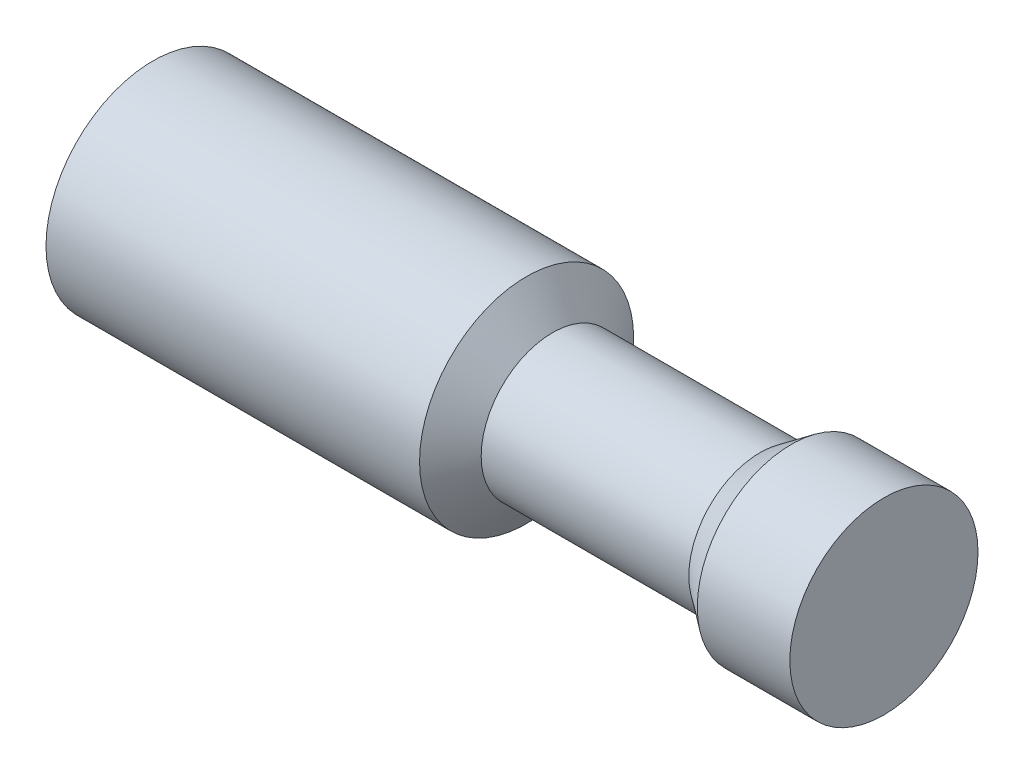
ISO-10303-21;
HEADER;
FILE_DESCRIPTION(('STEP AP214'),'2;1');
FILE_NAME('part.step','',(''),(''),'','','');
FILE_SCHEMA(('AUTOMOTIVE_DESIGN { 1 0 10303 214 1 1 1 1 }'));
ENDSEC;
DATA;
#1=APPLICATION_CONTEXT('core data for automotive mechanical design processes');
#2=APPLICATION_PROTOCOL_DEFINITION('international standard','automotive_design',2000,#1);
#3=PRODUCT_CONTEXT('',#1,'mechanical');
#4=PRODUCT('Part','Part','',(#3));
#5=PRODUCT_RELATED_PRODUCT_CATEGORY('part','',(#4));
#6=PRODUCT_DEFINITION_FORMATION('','',#4);
#7=PRODUCT_DEFINITION_CONTEXT('part definition',#1,'design');
#8=PRODUCT_DEFINITION('design','',#6,#7);
#9=PRODUCT_DEFINITION_SHAPE('','',#8);
#10=(LENGTH_UNIT() NAMED_UNIT(*) SI_UNIT(.MILLI.,.METRE.));
#11=(NAMED_UNIT(*) PLANE_ANGLE_UNIT() SI_UNIT($,.RADIAN.));
#12=(NAMED_UNIT(*) SI_UNIT($,.STERADIAN.) SOLID_ANGLE_UNIT());
#13=UNCERTAINTY_MEASURE_WITH_UNIT(LENGTH_MEASURE(1.E-05),#10,'distance_accuracy_value','');
#14=(GEOMETRIC_REPRESENTATION_CONTEXT(3) GLOBAL_UNCERTAINTY_ASSIGNED_CONTEXT((#13)) GLOBAL_UNIT_ASSIGNED_CONTEXT((#10,
#11,#12)) REPRESENTATION_CONTEXT('',''));
#15=CARTESIAN_POINT('',(0.,0.,0.));
#16=DIRECTION('',(0.,0.,1.));
#17=DIRECTION('',(1.,0.,0.));
#18=AXIS2_PLACEMENT_3D('',#15,#16,#17);
#19=CARTESIAN_POINT('',(60.,10.75,0.));
#20=DIRECTION('',(1.,0.,0.));
#21=DIRECTION('',(0.,0.,-1.));
#22=AXIS2_PLACEMENT_3D('',#19,#20,#21);
#23=PLANE('',#22);
#24=CARTESIAN_POINT('',(60.,0.,0.));
#25=DIRECTION('',(1.,0.,0.));
#26=DIRECTION('',(0.,0.,-1.));
#27=AXIS2_PLACEMENT_3D('',#24,#25,#26);
#28=CIRCLE('',#27,7.7230359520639);
#29=CARTESIAN_POINT('',(60.,0.,-7.7230359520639));
#30=VERTEX_POINT('',#29);
#31=EDGE_CURVE('E36',#30,#30,#28,.T.);
#32=ORIENTED_EDGE('',*,*,#31,.T.);
#33=EDGE_LOOP('',(#32));
#34=FACE_BOUND('',#33,.T.);
#35=ADVANCED_FACE('F29',(#34),#23,.T.);
#36=CARTESIAN_POINT('',(0.,0.,0.));
#37=DIRECTION('',(-1.,0.,0.));
#38=DIRECTION('',(0.,0.,1.));
#39=AXIS2_PLACEMENT_3D('',#36,#37,#38);
#40=CYLINDRICAL_SURFACE('',#39,8.78828229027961);
#41=CARTESIAN_POINT('',(0.,0.,0.));
#42=DIRECTION('',(-1.,0.,0.));
#43=DIRECTION('',(0.,0.,1.));
#44=AXIS2_PLACEMENT_3D('',#41,#42,#43);
#45=CIRCLE('',#44,8.78828229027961);
#46=CARTESIAN_POINT('',(0.,0.,8.78828229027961));
#47=VERTEX_POINT('',#46);
#48=EDGE_CURVE('E10',#47,#47,#45,.T.);
#49=ORIENTED_EDGE('',*,*,#48,.F.);
#50=EDGE_LOOP('',(#49));
#51=FACE_BOUND('',#50,.T.);
#52=CARTESIAN_POINT('',(30.6657789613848,0.,0.));
#53=DIRECTION('',(-1.,0.,0.));
#54=DIRECTION('',(0.,0.,1.));
#55=AXIS2_PLACEMENT_3D('',#52,#53,#54);
#56=CIRCLE('',#55,8.78828229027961);
#57=CARTESIAN_POINT('',(30.6657789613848,0.,8.78828229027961));
#58=VERTEX_POINT('',#57);
#59=EDGE_CURVE('E40',#58,#58,#56,.T.);
#60=ORIENTED_EDGE('',*,*,#59,.T.);
#61=EDGE_LOOP('',(#60));
#62=FACE_BOUND('',#61,.T.);
#63=ADVANCED_FACE('F70',(#51,#62),#40,.T.);
#64=CARTESIAN_POINT('',(30.6657789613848,0.,0.));
#65=DIRECTION('',(-1.,0.,0.));
#66=DIRECTION('',(0.,0.,1.));
#67=AXIS2_PLACEMENT_3D('',#64,#65,#66);
#68=CONICAL_SURFACE('',#67,8.78828229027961,0.942000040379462);
#69=CARTESIAN_POINT('',(32.7962716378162,0.,0.));
#70=DIRECTION('',(-1.,0.,0.));
#71=DIRECTION('',(0.,0.,1.));
#72=AXIS2_PLACEMENT_3D('',#69,#70,#71);
#73=CIRCLE('',#72,5.85885486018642);
#74=CARTESIAN_POINT('',(32.7962716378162,0.,5.85885486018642));
#75=VERTEX_POINT('',#74);
#76=EDGE_CURVE('E44',#75,#75,#73,.T.);
#77=ORIENTED_EDGE('',*,*,#76,.T.);
#78=EDGE_LOOP('',(#77));
#79=FACE_BOUND('',#78,.T.);
#80=ORIENTED_EDGE('',*,*,#59,.F.);
#81=EDGE_LOOP('',(#80));
#82=FACE_BOUND('',#81,.T.);
#83=ADVANCED_FACE('F74',(#79,#82),#68,.T.);
#84=CARTESIAN_POINT('',(0.,0.,0.));
#85=DIRECTION('',(-1.,0.,0.));
#86=DIRECTION('',(0.,0.,1.));
#87=AXIS2_PLACEMENT_3D('',#84,#85,#86);
#88=CYLINDRICAL_SURFACE('',#87,5.85885486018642);
#89=CARTESIAN_POINT('',(49.8402130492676,0.,0.));
#90=DIRECTION('',(-1.,0.,0.));
#91=DIRECTION('',(0.,0.,1.));
#92=AXIS2_PLACEMENT_3D('',#89,#90,#91);
#93=CIRCLE('',#92,5.85885486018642);
#94=CARTESIAN_POINT('',(49.8402130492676,0.,5.85885486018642));
#95=VERTEX_POINT('',#94);
#96=EDGE_CURVE('E49',#95,#95,#93,.T.);
#97=ORIENTED_EDGE('',*,*,#96,.T.);
#98=EDGE_LOOP('',(#97));
#99=FACE_BOUND('',#98,.T.);
#100=ORIENTED_EDGE('',*,*,#76,.F.);
#101=EDGE_LOOP('',(#100));
#102=FACE_BOUND('',#101,.T.);
#103=ADVANCED_FACE('F67',(#99,#102),#88,.T.);
#104=CARTESIAN_POINT('',(49.8402130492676,0.,0.));
#105=DIRECTION('',(1.,0.,0.));
#106=DIRECTION('',(0.,0.,-1.));
#107=AXIS2_PLACEMENT_3D('',#104,#105,#106);
#108=CONICAL_SURFACE('',#107,5.85885486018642,0.628796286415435);
#109=CARTESIAN_POINT('',(52.4034620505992,0.,0.));
#110=DIRECTION('',(-1.,0.,0.));
#111=DIRECTION('',(0.,0.,1.));
#112=AXIS2_PLACEMENT_3D('',#109,#110,#111);
#113=CIRCLE('',#112,7.72303595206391);
#114=CARTESIAN_POINT('',(52.4034620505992,0.,7.72303595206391));
#115=VERTEX_POINT('',#114);
#116=EDGE_CURVE('E52',#115,#115,#113,.T.);
#117=ORIENTED_EDGE('',*,*,#116,.T.);
#118=EDGE_LOOP('',(#117));
#119=FACE_BOUND('',#118,.T.);
#120=ORIENTED_EDGE('',*,*,#96,.F.);
#121=EDGE_LOOP('',(#120));
#122=FACE_BOUND('',#121,.T.);
#123=ADVANCED_FACE('F56',(#119,#122),#108,.T.);
#124=CARTESIAN_POINT('',(0.,0.,0.));
#125=DIRECTION('',(-1.,0.,0.));
#126=DIRECTION('',(0.,0.,1.));
#127=AXIS2_PLACEMENT_3D('',#124,#125,#126);
#128=CYLINDRICAL_SURFACE('',#127,7.7230359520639);
#129=ORIENTED_EDGE('',*,*,#31,.F.);
#130=EDGE_LOOP('',(#129));
#131=FACE_BOUND('',#130,.T.);
#132=ORIENTED_EDGE('',*,*,#116,.F.);
#133=EDGE_LOOP('',(#132));
#134=FACE_BOUND('',#133,.T.);
#135=ADVANCED_FACE('F59',(#131,#134),#128,.T.);
#136=CARTESIAN_POINT('',(0.,0.,0.));
#137=DIRECTION('',(-1.,0.,0.));
#138=DIRECTION('',(0.,0.,1.));
#139=AXIS2_PLACEMENT_3D('',#136,#137,#138);
#140=PLANE('',#139);
#141=ORIENTED_EDGE('',*,*,#48,.T.);
#142=EDGE_LOOP('',(#141));
#143=FACE_BOUND('',#142,.T.);
#144=ADVANCED_FACE('F31',(#143),#140,.T.);
#145=CLOSED_SHELL('',(#35,#63,#83,#103,#123,#135,#144));
#146=MANIFOLD_SOLID_BREP('B2',#145);
#147=ADVANCED_BREP_SHAPE_REPRESENTATION('',(#18,#146),#14);
#148=SHAPE_DEFINITION_REPRESENTATION(#9,#147);
ENDSEC;
END-ISO-10303-21;
